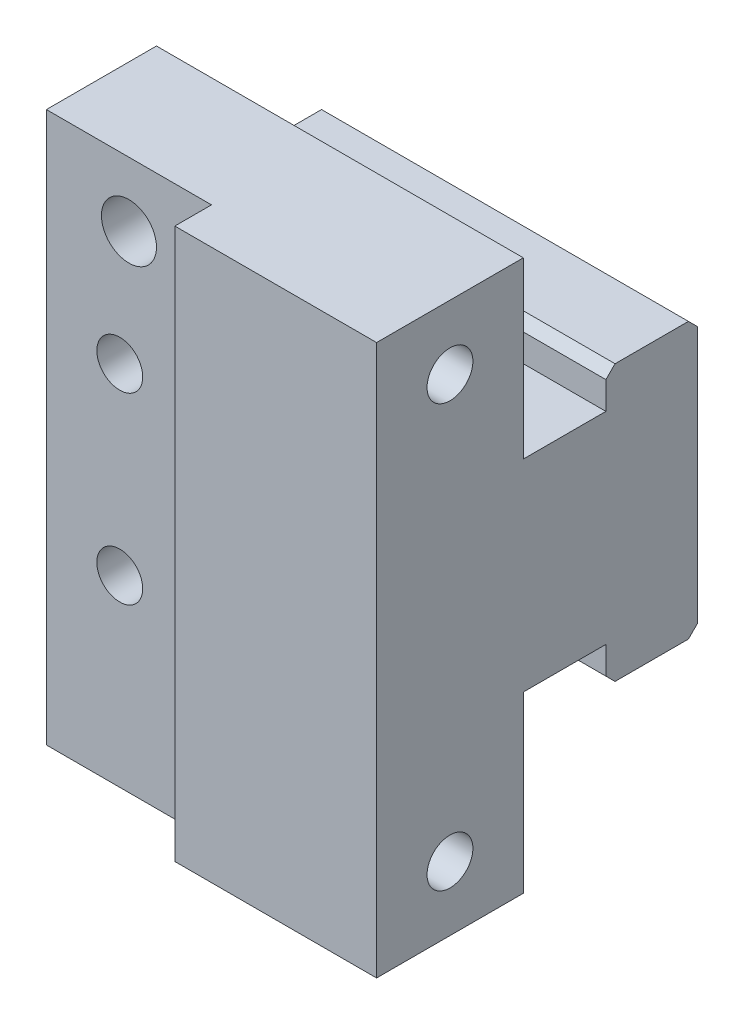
ISO-10303-21;
HEADER;
FILE_DESCRIPTION(('STEP AP214'),'2;1');
FILE_NAME('part.step','',(''),(''),'','','');
FILE_SCHEMA(('AUTOMOTIVE_DESIGN { 1 0 10303 214 1 1 1 1 }'));
ENDSEC;
DATA;
#1=APPLICATION_CONTEXT('core data for automotive mechanical design processes');
#2=APPLICATION_PROTOCOL_DEFINITION('international standard','automotive_design',2000,#1);
#3=PRODUCT_CONTEXT('',#1,'mechanical');
#4=PRODUCT('Part','Part','',(#3));
#5=PRODUCT_RELATED_PRODUCT_CATEGORY('part','',(#4));
#6=PRODUCT_DEFINITION_FORMATION('','',#4);
#7=PRODUCT_DEFINITION_CONTEXT('part definition',#1,'design');
#8=PRODUCT_DEFINITION('design','',#6,#7);
#9=PRODUCT_DEFINITION_SHAPE('','',#8);
#10=(LENGTH_UNIT() NAMED_UNIT(*) SI_UNIT(.MILLI.,.METRE.));
#11=(NAMED_UNIT(*) PLANE_ANGLE_UNIT() SI_UNIT($,.RADIAN.));
#12=(NAMED_UNIT(*) SI_UNIT($,.STERADIAN.) SOLID_ANGLE_UNIT());
#13=UNCERTAINTY_MEASURE_WITH_UNIT(LENGTH_MEASURE(1.E-05),#10,'distance_accuracy_value','');
#14=(GEOMETRIC_REPRESENTATION_CONTEXT(3) GLOBAL_UNCERTAINTY_ASSIGNED_CONTEXT((#13)) GLOBAL_UNIT_ASSIGNED_CONTEXT((#10,
#11,#12)) REPRESENTATION_CONTEXT('',''));
#15=CARTESIAN_POINT('',(0.,0.,0.));
#16=DIRECTION('',(0.,0.,1.));
#17=DIRECTION('',(1.,0.,0.));
#18=AXIS2_PLACEMENT_3D('',#15,#16,#17);
#19=CARTESIAN_POINT('',(0.,-30.,0.));
#20=DIRECTION('',(1.,0.,0.));
#21=DIRECTION('',(0.,0.,-1.));
#22=AXIS2_PLACEMENT_3D('',#19,#20,#21);
#23=PLANE('',#22);
#24=DIRECTION('',(0.,0.,1.));
#25=VECTOR('',#24,1.);
#26=CARTESIAN_POINT('',(0.,-7.5,-12.5));
#27=LINE('',#26,#25);
#28=CARTESIAN_POINT('',(0.,-7.5,-17.));
#29=VERTEX_POINT('',#28);
#30=CARTESIAN_POINT('',(0.,-7.5,-13.));
#31=VERTEX_POINT('',#30);
#32=EDGE_CURVE('E296',#29,#31,#27,.T.);
#33=ORIENTED_EDGE('',*,*,#32,.F.);
#34=DIRECTION('',(0.,0.707106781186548,0.707106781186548));
#35=VECTOR('',#34,1.);
#36=CARTESIAN_POINT('',(0.,-7.5,-17.));
#37=LINE('',#36,#35);
#38=CARTESIAN_POINT('',(0.,-7.99999999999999,-17.5));
#39=VERTEX_POINT('',#38);
#40=EDGE_CURVE('E455',#29,#39,#37,.F.);
#41=ORIENTED_EDGE('',*,*,#40,.T.);
#42=DIRECTION('',(0.,1.,0.));
#43=VECTOR('',#42,1.);
#44=CARTESIAN_POINT('',(0.,-7.5,-17.5));
#45=LINE('',#44,#43);
#46=CARTESIAN_POINT('',(0.,-22.,-17.5));
#47=VERTEX_POINT('',#46);
#48=EDGE_CURVE('E293',#47,#39,#45,.T.);
#49=ORIENTED_EDGE('',*,*,#48,.F.);
#50=DIRECTION('',(0.,0.707106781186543,-0.707106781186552));
#51=VECTOR('',#50,1.);
#52=CARTESIAN_POINT('',(0.,-22.,-17.5));
#53=LINE('',#52,#51);
#54=CARTESIAN_POINT('',(0.,-22.5,-17.));
#55=VERTEX_POINT('',#54);
#56=EDGE_CURVE('E449',#47,#55,#53,.F.);
#57=ORIENTED_EDGE('',*,*,#56,.T.);
#58=DIRECTION('',(0.,0.,-1.));
#59=VECTOR('',#58,1.);
#60=CARTESIAN_POINT('',(0.,-22.5,-12.5));
#61=LINE('',#60,#59);
#62=CARTESIAN_POINT('',(0.,-22.5,-13.));
#63=VERTEX_POINT('',#62);
#64=EDGE_CURVE('E291',#63,#55,#61,.T.);
#65=ORIENTED_EDGE('',*,*,#64,.F.);
#66=DIRECTION('',(0.,-0.70710678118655,-0.707106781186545));
#67=VECTOR('',#66,1.);
#68=CARTESIAN_POINT('',(0.,-22.5,-13.));
#69=LINE('',#68,#67);
#70=CARTESIAN_POINT('',(0.,-22.,-12.5));
#71=VERTEX_POINT('',#70);
#72=EDGE_CURVE('E451',#63,#71,#69,.F.);
#73=ORIENTED_EDGE('',*,*,#72,.T.);
#74=DIRECTION('',(0.,-1.,0.));
#75=VECTOR('',#74,1.);
#76=CARTESIAN_POINT('',(0.,-22.5,-12.5));
#77=LINE('',#76,#75);
#78=CARTESIAN_POINT('',(0.,-20.5,-12.5));
#79=VERTEX_POINT('',#78);
#80=EDGE_CURVE('E288',#79,#71,#77,.T.);
#81=ORIENTED_EDGE('',*,*,#80,.F.);
#82=DIRECTION('',(0.,0.,-1.));
#83=VECTOR('',#82,1.);
#84=CARTESIAN_POINT('',(0.,-20.5,-8.));
#85=LINE('',#84,#83);
#86=CARTESIAN_POINT('',(0.,-20.5,-8.));
#87=VERTEX_POINT('',#86);
#88=EDGE_CURVE('E286',#87,#79,#85,.T.);
#89=ORIENTED_EDGE('',*,*,#88,.F.);
#90=DIRECTION('',(0.,1.,0.));
#91=VECTOR('',#90,1.);
#92=CARTESIAN_POINT('',(0.,-30.,-8.));
#93=LINE('',#92,#91);
#94=CARTESIAN_POINT('',(0.,-30.,-8.));
#95=VERTEX_POINT('',#94);
#96=EDGE_CURVE('E283',#95,#87,#93,.T.);
#97=ORIENTED_EDGE('',*,*,#96,.F.);
#98=DIRECTION('',(0.,0.,-1.));
#99=VECTOR('',#98,1.);
#100=CARTESIAN_POINT('',(0.,-30.,0.));
#101=LINE('',#100,#99);
#102=CARTESIAN_POINT('',(0.,-30.,-2.));
#103=VERTEX_POINT('',#102);
#104=EDGE_CURVE('E251',#103,#95,#101,.T.);
#105=ORIENTED_EDGE('',*,*,#104,.F.);
#106=DIRECTION('',(0.,-1.,0.));
#107=VECTOR('',#106,1.);
#108=CARTESIAN_POINT('',(0.,0.,-2.));
#109=LINE('',#108,#107);
#110=CARTESIAN_POINT('',(0.,0.,-2.));
#111=VERTEX_POINT('',#110);
#112=EDGE_CURVE('E236',#111,#103,#109,.T.);
#113=ORIENTED_EDGE('',*,*,#112,.F.);
#114=DIRECTION('',(0.,0.,1.));
#115=VECTOR('',#114,1.);
#116=CARTESIAN_POINT('',(0.,0.,0.));
#117=LINE('',#116,#115);
#118=CARTESIAN_POINT('',(0.,0.,-8.));
#119=VERTEX_POINT('',#118);
#120=EDGE_CURVE('E257',#119,#111,#117,.T.);
#121=ORIENTED_EDGE('',*,*,#120,.F.);
#122=DIRECTION('',(0.,1.,0.));
#123=VECTOR('',#122,1.);
#124=CARTESIAN_POINT('',(0.,0.,-8.));
#125=LINE('',#124,#123);
#126=CARTESIAN_POINT('',(0.,-9.5,-8.));
#127=VERTEX_POINT('',#126);
#128=EDGE_CURVE('E304',#127,#119,#125,.T.);
#129=ORIENTED_EDGE('',*,*,#128,.F.);
#130=DIRECTION('',(0.,0.,1.));
#131=VECTOR('',#130,1.);
#132=CARTESIAN_POINT('',(0.,-9.5,-8.));
#133=LINE('',#132,#131);
#134=CARTESIAN_POINT('',(0.,-9.5,-12.5));
#135=VERTEX_POINT('',#134);
#136=EDGE_CURVE('E301',#135,#127,#133,.T.);
#137=ORIENTED_EDGE('',*,*,#136,.F.);
#138=DIRECTION('',(0.,-1.,0.));
#139=VECTOR('',#138,1.);
#140=CARTESIAN_POINT('',(0.,-7.5,-12.5));
#141=LINE('',#140,#139);
#142=CARTESIAN_POINT('',(0.,-8.,-12.5));
#143=VERTEX_POINT('',#142);
#144=EDGE_CURVE('E299',#143,#135,#141,.T.);
#145=ORIENTED_EDGE('',*,*,#144,.F.);
#146=DIRECTION('',(0.,-0.707106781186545,0.70710678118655));
#147=VECTOR('',#146,1.);
#148=CARTESIAN_POINT('',(0.,-8.,-12.5));
#149=LINE('',#148,#147);
#150=EDGE_CURVE('E453',#143,#31,#149,.F.);
#151=ORIENTED_EDGE('',*,*,#150,.T.);
#152=EDGE_LOOP('',(#33,#41,#49,#57,#65,#73,#81,#89,#97,#105,#113,#121,#129,#137,#145,#151));
#153=FACE_BOUND('',#152,.T.);
#154=ADVANCED_FACE('F32',(#153),#23,.F.);
#155=CARTESIAN_POINT('',(20.,0.,0.));
#156=DIRECTION('',(0.,0.,-1.));
#157=DIRECTION('',(-1.,0.,0.));
#158=AXIS2_PLACEMENT_3D('',#155,#156,#157);
#159=PLANE('',#158);
#160=DIRECTION('',(-1.,0.,0.));
#161=VECTOR('',#160,1.);
#162=CARTESIAN_POINT('',(20.,0.,0.));
#163=LINE('',#162,#161);
#164=CARTESIAN_POINT('',(20.,0.,0.));
#165=VERTEX_POINT('',#164);
#166=CARTESIAN_POINT('',(9.,0.,0.));
#167=VERTEX_POINT('',#166);
#168=EDGE_CURVE('E281',#165,#167,#163,.T.);
#169=ORIENTED_EDGE('',*,*,#168,.T.);
#170=DIRECTION('',(0.,1.,0.));
#171=VECTOR('',#170,1.);
#172=CARTESIAN_POINT('',(9.,0.,0.));
#173=LINE('',#172,#171);
#174=CARTESIAN_POINT('',(9.,-30.,0.));
#175=VERTEX_POINT('',#174);
#176=EDGE_CURVE('E235',#175,#167,#173,.T.);
#177=ORIENTED_EDGE('',*,*,#176,.F.);
#178=DIRECTION('',(-1.,0.,0.));
#179=VECTOR('',#178,1.);
#180=CARTESIAN_POINT('',(20.,-30.,0.));
#181=LINE('',#180,#179);
#182=CARTESIAN_POINT('',(20.,-30.,0.));
#183=VERTEX_POINT('',#182);
#184=EDGE_CURVE('E330',#183,#175,#181,.T.);
#185=ORIENTED_EDGE('',*,*,#184,.F.);
#186=DIRECTION('',(0.,-1.,0.));
#187=VECTOR('',#186,1.);
#188=CARTESIAN_POINT('',(20.,0.,0.));
#189=LINE('',#188,#187);
#190=EDGE_CURVE('E253',#165,#183,#189,.T.);
#191=ORIENTED_EDGE('',*,*,#190,.F.);
#192=EDGE_LOOP('',(#169,#177,#185,#191));
#193=FACE_BOUND('',#192,.T.);
#194=ADVANCED_FACE('F362',(#193),#159,.F.);
#195=CARTESIAN_POINT('',(20.,-30.,0.));
#196=DIRECTION('',(0.,1.,0.));
#197=DIRECTION('',(0.,0.,1.));
#198=AXIS2_PLACEMENT_3D('',#195,#196,#197);
#199=PLANE('',#198);
#200=ORIENTED_EDGE('',*,*,#184,.T.);
#201=DIRECTION('',(0.,0.,1.));
#202=VECTOR('',#201,1.);
#203=CARTESIAN_POINT('',(9.,-30.,-2.));
#204=LINE('',#203,#202);
#205=CARTESIAN_POINT('',(9.,-30.,-2.));
#206=VERTEX_POINT('',#205);
#207=EDGE_CURVE('E246',#206,#175,#204,.T.);
#208=ORIENTED_EDGE('',*,*,#207,.F.);
#209=DIRECTION('',(1.,0.,0.));
#210=VECTOR('',#209,1.);
#211=CARTESIAN_POINT('',(0.,-30.,-2.));
#212=LINE('',#211,#210);
#213=EDGE_CURVE('E238',#103,#206,#212,.T.);
#214=ORIENTED_EDGE('',*,*,#213,.F.);
#215=ORIENTED_EDGE('',*,*,#104,.T.);
#216=DIRECTION('',(-1.,0.,0.));
#217=VECTOR('',#216,1.);
#218=CARTESIAN_POINT('',(20.,-30.,-8.));
#219=LINE('',#218,#217);
#220=CARTESIAN_POINT('',(20.,-30.,-8.));
#221=VERTEX_POINT('',#220);
#222=EDGE_CURVE('E327',#221,#95,#219,.T.);
#223=ORIENTED_EDGE('',*,*,#222,.F.);
#224=DIRECTION('',(0.,0.,-1.));
#225=VECTOR('',#224,1.);
#226=CARTESIAN_POINT('',(20.,-30.,0.));
#227=LINE('',#226,#225);
#228=EDGE_CURVE('E256',#183,#221,#227,.T.);
#229=ORIENTED_EDGE('',*,*,#228,.F.);
#230=EDGE_LOOP('',(#200,#208,#214,#215,#223,#229));
#231=FACE_BOUND('',#230,.T.);
#232=ADVANCED_FACE('F358',(#231),#199,.F.);
#233=CARTESIAN_POINT('',(20.,-30.,-8.));
#234=DIRECTION('',(0.,0.,1.));
#235=DIRECTION('',(0.,-1.,0.));
#236=AXIS2_PLACEMENT_3D('',#233,#234,#235);
#237=PLANE('',#236);
#238=DIRECTION('',(-1.,0.,0.));
#239=VECTOR('',#238,1.);
#240=CARTESIAN_POINT('',(20.,-20.5,-8.));
#241=LINE('',#240,#239);
#242=CARTESIAN_POINT('',(2.85435607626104,-20.5,-8.));
#243=VERTEX_POINT('',#242);
#244=EDGE_CURVE('E323',#243,#87,#241,.T.);
#245=ORIENTED_EDGE('',*,*,#244,.F.);
#246=CARTESIAN_POINT('',(4.,-20.,-8.));
#247=DIRECTION('',(0.,0.,1.));
#248=DIRECTION('',(0.,-1.,0.));
#249=AXIS2_PLACEMENT_3D('',#246,#247,#248);
#250=CIRCLE('',#249,1.25);
#251=CARTESIAN_POINT('',(5.14564392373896,-20.5,-8.));
#252=VERTEX_POINT('',#251);
#253=EDGE_CURVE('E232',#243,#252,#250,.T.);
#254=ORIENTED_EDGE('',*,*,#253,.T.);
#255=CARTESIAN_POINT('',(20.,-20.5,-8.));
#256=VERTEX_POINT('',#255);
#257=EDGE_CURVE('E324',#256,#252,#241,.T.);
#258=ORIENTED_EDGE('',*,*,#257,.F.);
#259=DIRECTION('',(0.,1.,0.));
#260=VECTOR('',#259,1.);
#261=CARTESIAN_POINT('',(20.,-30.,-8.));
#262=LINE('',#261,#260);
#263=EDGE_CURVE('E259',#221,#256,#262,.T.);
#264=ORIENTED_EDGE('',*,*,#263,.F.);
#265=ORIENTED_EDGE('',*,*,#222,.T.);
#266=ORIENTED_EDGE('',*,*,#96,.T.);
#267=EDGE_LOOP('',(#245,#254,#258,#264,#265,#266));
#268=FACE_BOUND('',#267,.T.);
#269=ADVANCED_FACE('F353',(#268),#237,.F.);
#270=CARTESIAN_POINT('',(20.,-20.5,-8.));
#271=DIRECTION('',(0.,1.,0.));
#272=DIRECTION('',(0.,0.,1.));
#273=AXIS2_PLACEMENT_3D('',#270,#271,#272);
#274=PLANE('',#273);
#275=CARTESIAN_POINT('',(-2.41999922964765,-20.5,-6.38186974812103));
#276=CARTESIAN_POINT('',(-2.19441727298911,-20.5,-6.51700026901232));
#277=CARTESIAN_POINT('',(-1.96881932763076,-20.5,-6.65210413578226));
#278=CARTESIAN_POINT('',(-1.51756293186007,-20.5,-6.92222668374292));
#279=CARTESIAN_POINT('',(-1.29190447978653,-20.5,-7.05724536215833));
#280=CARTESIAN_POINT('',(-0.840333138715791,-20.5,-7.32726453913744));
#281=CARTESIAN_POINT('',(-0.614420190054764,-20.5,-7.4622649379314));
#282=CARTESIAN_POINT('',(-0.162486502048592,-20.5,-7.73206975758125));
#283=CARTESIAN_POINT('',(0.0635342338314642,-20.5,-7.86687418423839));
#284=CARTESIAN_POINT('',(0.512094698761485,-20.5,-8.13398164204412));
#285=CARTESIAN_POINT('',(0.734631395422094,-20.5,-8.26628976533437));
#286=CARTESIAN_POINT('',(1.18003986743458,-20.5,-8.53038665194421));
#287=CARTESIAN_POINT('',(1.40291167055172,-20.5,-8.66217536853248));
#288=CARTESIAN_POINT('',(1.73765614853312,-20.5,-8.85898572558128));
#289=CARTESIAN_POINT('',(1.8492817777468,-20.5,-8.92442706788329));
#290=CARTESIAN_POINT('',(2.072797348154,-20.5,-9.05486545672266));
#291=CARTESIAN_POINT('',(2.18468729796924,-20.5,-9.11986248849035));
#292=CARTESIAN_POINT('',(2.40886995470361,-20.5,-9.24911943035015));
#293=CARTESIAN_POINT('',(2.52116259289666,-20.5,-9.31337945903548));
#294=CARTESIAN_POINT('',(2.69017844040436,-20.5,-9.40874119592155));
#295=CARTESIAN_POINT('',(2.74661169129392,-20.5,-9.44035622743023));
#296=CARTESIAN_POINT('',(2.85975424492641,-20.5,-9.50308782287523));
#297=CARTESIAN_POINT('',(2.91646354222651,-20.5,-9.53420439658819));
#298=CARTESIAN_POINT('',(2.99680500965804,-20.5,-9.57760336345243));
#299=CARTESIAN_POINT('',(3.02026927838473,-20.5,-9.59019641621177));
#300=CARTESIAN_POINT('',(3.06728021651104,-20.5,-9.61522790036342));
#301=CARTESIAN_POINT('',(3.09082688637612,-20.5,-9.62766633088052));
#302=CARTESIAN_POINT('',(3.16162039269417,-20.5,-9.6647091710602));
#303=CARTESIAN_POINT('',(3.20901319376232,-20.5,-9.68903703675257));
#304=CARTESIAN_POINT('',(3.304743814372,-20.5,-9.73676563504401));
#305=CARTESIAN_POINT('',(3.35308617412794,-20.5,-9.76015729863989));
#306=CARTESIAN_POINT('',(3.4506116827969,-20.5,-9.80512578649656));
#307=CARTESIAN_POINT('',(3.49979459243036,-20.5,-9.8267031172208));
#308=CARTESIAN_POINT('',(3.57871586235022,-20.5,-9.85843329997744));
#309=CARTESIAN_POINT('',(3.60803998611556,-20.5,-9.86960714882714));
#310=CARTESIAN_POINT('',(3.66722630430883,-20.5,-9.8904781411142));
#311=CARTESIAN_POINT('',(3.69708863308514,-20.5,-9.90017490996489));
#312=CARTESIAN_POINT('',(3.75701051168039,-20.5,-9.9174153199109));
#313=CARTESIAN_POINT('',(3.78706209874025,-20.5,-9.92498599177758));
#314=CARTESIAN_POINT('',(3.84769885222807,-20.5,-9.93748189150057));
#315=CARTESIAN_POINT('',(3.87828347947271,-20.5,-9.94240964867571));
#316=CARTESIAN_POINT('',(3.94048505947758,-20.5,-9.9490934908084));
#317=CARTESIAN_POINT('',(3.97211002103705,-20.5,-9.95077853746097));
#318=CARTESIAN_POINT('',(4.03533806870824,-20.5,-9.95049572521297));
#319=CARTESIAN_POINT('',(4.06694115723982,-20.5,-9.94852837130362));
#320=CARTESIAN_POINT('',(4.13013712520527,-20.5,-9.94120511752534));
#321=CARTESIAN_POINT('',(4.16172488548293,-20.5,-9.93580694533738));
#322=CARTESIAN_POINT('',(4.22430707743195,-20.5,-9.9222677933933));
#323=CARTESIAN_POINT('',(4.25530108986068,-20.5,-9.91412494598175));
#324=CARTESIAN_POINT('',(4.3305838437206,-20.5,-9.89167341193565));
#325=CARTESIAN_POINT('',(4.37453102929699,-20.5,-9.87624289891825));
#326=CARTESIAN_POINT('',(4.46142581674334,-20.5,-9.84275330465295));
#327=CARTESIAN_POINT('',(4.50437233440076,-20.5,-9.82469151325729));
#328=CARTESIAN_POINT('',(4.58962701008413,-20.5,-9.78688110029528));
#329=CARTESIAN_POINT('',(4.63193346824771,-20.5,-9.76712868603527));
#330=CARTESIAN_POINT('',(4.71602750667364,-20.5,-9.72654336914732));
#331=CARTESIAN_POINT('',(4.75781500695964,-20.5,-9.70571030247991));
#332=CARTESIAN_POINT('',(4.88350348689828,-20.5,-9.64169600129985));
#333=CARTESIAN_POINT('',(4.9668413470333,-20.5,-9.59741452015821));
#334=CARTESIAN_POINT('',(5.13256928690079,-20.5,-9.50749061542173));
#335=CARTESIAN_POINT('',(5.21496082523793,-20.5,-9.46185083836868));
#336=CARTESIAN_POINT('',(5.38026226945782,-20.5,-9.36917534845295));
#337=CARTESIAN_POINT('',(5.46316645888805,-20.5,-9.32212944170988));
#338=CARTESIAN_POINT('',(5.62867047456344,-20.5,-9.22750653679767));
#339=CARTESIAN_POINT('',(5.71127029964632,-20.5,-9.17992953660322));
#340=CARTESIAN_POINT('',(5.9587800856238,-20.5,-9.03668029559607));
#341=CARTESIAN_POINT('',(6.12339245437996,-20.5,-8.94049430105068));
#342=CARTESIAN_POINT('',(6.4523773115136,-20.5,-8.74736638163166));
#343=CARTESIAN_POINT('',(6.61674943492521,-20.5,-8.65042383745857));
#344=CARTESIAN_POINT('',(6.94525908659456,-20.5,-8.45615070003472));
#345=CARTESIAN_POINT('',(7.10939662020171,-20.5,-8.35882011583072));
#346=CARTESIAN_POINT('',(7.42739732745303,-20.5,-8.16993543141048));
#347=CARTESIAN_POINT('',(7.58126907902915,-20.5,-8.07839575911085));
#348=CARTESIAN_POINT('',(7.8889272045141,-20.5,-7.89517041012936));
#349=CARTESIAN_POINT('',(8.0427135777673,-20.5,-7.8034847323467));
#350=CARTESIAN_POINT('',(8.35007033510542,-20.5,-7.62010336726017));
#351=CARTESIAN_POINT('',(8.50364078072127,-20.5,-7.52840778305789));
#352=CARTESIAN_POINT('',(8.81073446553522,-20.5,-7.34494042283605));
#353=CARTESIAN_POINT('',(8.96425770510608,-20.5,-7.25316864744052));
#354=CARTESIAN_POINT('',(9.11776548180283,-20.5,-7.16137103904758));
#355=B_SPLINE_CURVE_WITH_KNOTS('',3,(#275,#276,#277,#278,#279,#280,#281,#282,#283,#284,#285,
#286,#287,#288,#289,#290,#291,#292,#293,#294,#295,#296,#297,#298,#299,#300,#301,#302,#303,#304,
#305,#306,#307,#308,#309,#310,#311,#312,#313,#314,#315,#316,#317,#318,#319,#320,#321,#322,#323,
#324,#325,#326,#327,#328,#329,#330,#331,#332,#333,#334,#335,#336,#337,#338,#339,#340,#341,#342,
#343,#344,#345,#346,#347,#348,#349,#350,#351,#352,#353,#354),.UNSPECIFIED.,.F.,.F.,(4,2,2,2,2,2,
2,2,2,2,2,2,2,2,2,2,2,2,2,2,2,2,2,2,2,2,2,2,2,2,2,2,2,2,2,2,2,2,2,4),(0.,0.788877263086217,
1.57777902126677,2.36730789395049,3.15681289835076,3.93350580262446,4.71026706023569,
5.09844880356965,5.48664338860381,5.87477460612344,6.06882986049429,6.26288130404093,
6.34277076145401,6.42266067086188,6.58246620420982,6.74356169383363,6.90461206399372,
6.99872724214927,7.09286624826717,7.18574776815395,7.27854023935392,7.37334336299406,
7.46813337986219,7.56411459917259,7.66016126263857,7.79974185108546,7.93946723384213,
8.07951472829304,8.21958354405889,8.50266255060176,8.78522208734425,9.07118633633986,
9.35715167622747,9.92910961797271,10.50159896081,11.0740750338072,11.6112008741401,
12.1483307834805,12.6849196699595,13.2215042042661),.UNSPECIFIED.);
#356=CARTESIAN_POINT('',(5.14564392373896,-20.5,-9.5));
#357=VERTEX_POINT('',#356);
#358=CARTESIAN_POINT('',(2.85435607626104,-20.5,-9.5));
#359=VERTEX_POINT('',#358);
#360=EDGE_CURVE('E333',#357,#359,#355,.F.);
#361=ORIENTED_EDGE('',*,*,#360,.T.);
#362=DIRECTION('',(0.,0.,1.));
#363=VECTOR('',#362,1.);
#364=CARTESIAN_POINT('',(2.85435607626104,-20.5,-2.));
#365=LINE('',#364,#363);
#366=EDGE_CURVE('E416',#359,#243,#365,.T.);
#367=ORIENTED_EDGE('',*,*,#366,.T.);
#368=ORIENTED_EDGE('',*,*,#244,.T.);
#369=ORIENTED_EDGE('',*,*,#88,.T.);
#370=DIRECTION('',(-1.,0.,0.));
#371=VECTOR('',#370,1.);
#372=CARTESIAN_POINT('',(20.,-20.5,-12.5));
#373=LINE('',#372,#371);
#374=CARTESIAN_POINT('',(20.,-20.5,-12.5));
#375=VERTEX_POINT('',#374);
#376=EDGE_CURVE('E320',#375,#79,#373,.T.);
#377=ORIENTED_EDGE('',*,*,#376,.F.);
#378=DIRECTION('',(0.,0.,-1.));
#379=VECTOR('',#378,1.);
#380=CARTESIAN_POINT('',(20.,-20.5,-8.));
#381=LINE('',#380,#379);
#382=EDGE_CURVE('E261',#256,#375,#381,.T.);
#383=ORIENTED_EDGE('',*,*,#382,.F.);
#384=ORIENTED_EDGE('',*,*,#257,.T.);
#385=DIRECTION('',(0.,0.,1.));
#386=VECTOR('',#385,1.);
#387=CARTESIAN_POINT('',(5.14564392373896,-20.5,-2.));
#388=LINE('',#387,#386);
#389=EDGE_CURVE('E341',#252,#357,#388,.F.);
#390=ORIENTED_EDGE('',*,*,#389,.T.);
#391=EDGE_LOOP('',(#361,#367,#368,#369,#377,#383,#384,#390));
#392=FACE_BOUND('',#391,.T.);
#393=ADVANCED_FACE('F347',(#392),#274,.F.);
#394=CARTESIAN_POINT('',(20.,-22.5,-12.5));
#395=DIRECTION('',(0.,0.,-1.));
#396=DIRECTION('',(-1.,0.,0.));
#397=AXIS2_PLACEMENT_3D('',#394,#395,#396);
#398=PLANE('',#397);
#399=ORIENTED_EDGE('',*,*,#80,.T.);
#400=DIRECTION('',(1.,0.,0.));
#401=VECTOR('',#400,1.);
#402=CARTESIAN_POINT('',(20.,-22.,-12.5));
#403=LINE('',#402,#401);
#404=CARTESIAN_POINT('',(20.,-22.,-12.5));
#405=VERTEX_POINT('',#404);
#406=EDGE_CURVE('E11',#71,#405,#403,.T.);
#407=ORIENTED_EDGE('',*,*,#406,.T.);
#408=DIRECTION('',(0.,-1.,0.));
#409=VECTOR('',#408,1.);
#410=CARTESIAN_POINT('',(20.,-22.5,-12.5));
#411=LINE('',#410,#409);
#412=EDGE_CURVE('E263',#375,#405,#411,.T.);
#413=ORIENTED_EDGE('',*,*,#412,.F.);
#414=ORIENTED_EDGE('',*,*,#376,.T.);
#415=EDGE_LOOP('',(#399,#407,#413,#414));
#416=FACE_BOUND('',#415,.T.);
#417=ADVANCED_FACE('F352',(#416),#398,.F.);
#418=CARTESIAN_POINT('',(20.,-22.5,-12.5));
#419=DIRECTION('',(0.,1.,0.));
#420=DIRECTION('',(0.,0.,1.));
#421=AXIS2_PLACEMENT_3D('',#418,#419,#420);
#422=PLANE('',#421);
#423=DIRECTION('',(0.,0.,-1.));
#424=VECTOR('',#423,1.);
#425=CARTESIAN_POINT('',(20.,-22.5,-12.5));
#426=LINE('',#425,#424);
#427=CARTESIAN_POINT('',(20.,-22.5,-13.));
#428=VERTEX_POINT('',#427);
#429=CARTESIAN_POINT('',(20.,-22.5,-17.));
#430=VERTEX_POINT('',#429);
#431=EDGE_CURVE('E266',#428,#430,#426,.T.);
#432=ORIENTED_EDGE('',*,*,#431,.F.);
#433=DIRECTION('',(-1.,0.,0.));
#434=VECTOR('',#433,1.);
#435=CARTESIAN_POINT('',(20.,-22.5,-13.));
#436=LINE('',#435,#434);
#437=EDGE_CURVE('E40',#428,#63,#436,.T.);
#438=ORIENTED_EDGE('',*,*,#437,.T.);
#439=ORIENTED_EDGE('',*,*,#64,.T.);
#440=DIRECTION('',(1.,0.,0.));
#441=VECTOR('',#440,1.);
#442=CARTESIAN_POINT('',(20.,-22.5,-17.));
#443=LINE('',#442,#441);
#444=EDGE_CURVE('E55',#55,#430,#443,.T.);
#445=ORIENTED_EDGE('',*,*,#444,.T.);
#446=EDGE_LOOP('',(#432,#438,#439,#445));
#447=FACE_BOUND('',#446,.T.);
#448=ADVANCED_FACE('F475',(#447),#422,.F.);
#449=CARTESIAN_POINT('',(20.,-7.5,-17.5));
#450=DIRECTION('',(0.,0.,1.));
#451=DIRECTION('',(1.,0.,0.));
#452=AXIS2_PLACEMENT_3D('',#449,#450,#451);
#453=PLANE('',#452);
#454=ORIENTED_EDGE('',*,*,#48,.T.);
#455=DIRECTION('',(1.,0.,0.));
#456=VECTOR('',#455,1.);
#457=CARTESIAN_POINT('',(20.,-7.99999999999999,-17.5));
#458=LINE('',#457,#456);
#459=CARTESIAN_POINT('',(20.,-8.,-17.5));
#460=VERTEX_POINT('',#459);
#461=EDGE_CURVE('E460',#39,#460,#458,.T.);
#462=ORIENTED_EDGE('',*,*,#461,.T.);
#463=DIRECTION('',(0.,1.,0.));
#464=VECTOR('',#463,1.);
#465=CARTESIAN_POINT('',(20.,-7.5,-17.5));
#466=LINE('',#465,#464);
#467=CARTESIAN_POINT('',(20.,-22.,-17.5));
#468=VERTEX_POINT('',#467);
#469=EDGE_CURVE('E268',#468,#460,#466,.T.);
#470=ORIENTED_EDGE('',*,*,#469,.F.);
#471=DIRECTION('',(-1.,0.,0.));
#472=VECTOR('',#471,1.);
#473=CARTESIAN_POINT('',(20.,-22.,-17.5));
#474=LINE('',#473,#472);
#475=EDGE_CURVE('E457',#468,#47,#474,.T.);
#476=ORIENTED_EDGE('',*,*,#475,.T.);
#477=EDGE_LOOP('',(#454,#462,#470,#476));
#478=FACE_BOUND('',#477,.T.);
#479=ADVANCED_FACE('F482',(#478),#453,.F.);
#480=CARTESIAN_POINT('',(20.,-7.5,-12.5));
#481=DIRECTION('',(0.,-1.,0.));
#482=DIRECTION('',(0.,0.,-1.));
#483=AXIS2_PLACEMENT_3D('',#480,#481,#482);
#484=PLANE('',#483);
#485=DIRECTION('',(0.,0.,1.));
#486=VECTOR('',#485,1.);
#487=CARTESIAN_POINT('',(20.,-7.5,-12.5));
#488=LINE('',#487,#486);
#489=CARTESIAN_POINT('',(20.,-7.5,-17.));
#490=VERTEX_POINT('',#489);
#491=CARTESIAN_POINT('',(20.,-7.5,-13.));
#492=VERTEX_POINT('',#491);
#493=EDGE_CURVE('E271',#490,#492,#488,.T.);
#494=ORIENTED_EDGE('',*,*,#493,.F.);
#495=DIRECTION('',(-1.,0.,0.));
#496=VECTOR('',#495,1.);
#497=CARTESIAN_POINT('',(20.,-7.5,-17.));
#498=LINE('',#497,#496);
#499=EDGE_CURVE('E444',#490,#29,#498,.T.);
#500=ORIENTED_EDGE('',*,*,#499,.T.);
#501=ORIENTED_EDGE('',*,*,#32,.T.);
#502=DIRECTION('',(1.,0.,0.));
#503=VECTOR('',#502,1.);
#504=CARTESIAN_POINT('',(20.,-7.5,-13.));
#505=LINE('',#504,#503);
#506=EDGE_CURVE('E442',#31,#492,#505,.T.);
#507=ORIENTED_EDGE('',*,*,#506,.T.);
#508=EDGE_LOOP('',(#494,#500,#501,#507));
#509=FACE_BOUND('',#508,.T.);
#510=ADVANCED_FACE('F488',(#509),#484,.F.);
#511=CARTESIAN_POINT('',(20.,-7.5,-12.5));
#512=DIRECTION('',(0.,0.,-1.));
#513=DIRECTION('',(-1.,0.,0.));
#514=AXIS2_PLACEMENT_3D('',#511,#512,#513);
#515=PLANE('',#514);
#516=DIRECTION('',(0.,-1.,0.));
#517=VECTOR('',#516,1.);
#518=CARTESIAN_POINT('',(20.,-7.5,-12.5));
#519=LINE('',#518,#517);
#520=CARTESIAN_POINT('',(20.,-7.99999999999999,-12.5));
#521=VERTEX_POINT('',#520);
#522=CARTESIAN_POINT('',(20.,-9.5,-12.5));
#523=VERTEX_POINT('',#522);
#524=EDGE_CURVE('E273',#521,#523,#519,.T.);
#525=ORIENTED_EDGE('',*,*,#524,.F.);
#526=DIRECTION('',(-1.,0.,0.));
#527=VECTOR('',#526,1.);
#528=CARTESIAN_POINT('',(20.,-8.,-12.5));
#529=LINE('',#528,#527);
#530=EDGE_CURVE('E469',#521,#143,#529,.T.);
#531=ORIENTED_EDGE('',*,*,#530,.T.);
#532=ORIENTED_EDGE('',*,*,#144,.T.);
#533=DIRECTION('',(-1.,0.,0.));
#534=VECTOR('',#533,1.);
#535=CARTESIAN_POINT('',(20.,-9.5,-12.5));
#536=LINE('',#535,#534);
#537=EDGE_CURVE('E317',#523,#135,#536,.T.);
#538=ORIENTED_EDGE('',*,*,#537,.F.);
#539=EDGE_LOOP('',(#525,#531,#532,#538));
#540=FACE_BOUND('',#539,.T.);
#541=ADVANCED_FACE('F404',(#540),#515,.F.);
#542=CARTESIAN_POINT('',(20.,-9.5,-8.));
#543=DIRECTION('',(0.,-1.,0.));
#544=DIRECTION('',(0.,0.,-1.));
#545=AXIS2_PLACEMENT_3D('',#542,#543,#544);
#546=PLANE('',#545);
#547=CARTESIAN_POINT('',(-2.41999922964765,-9.5,-6.38186974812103));
#548=CARTESIAN_POINT('',(-2.19441727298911,-9.5,-6.51700026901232));
#549=CARTESIAN_POINT('',(-1.96881932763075,-9.5,-6.65210413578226));
#550=CARTESIAN_POINT('',(-1.51756293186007,-9.5,-6.92222668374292));
#551=CARTESIAN_POINT('',(-1.29190447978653,-9.5,-7.05724536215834));
#552=CARTESIAN_POINT('',(-0.840333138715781,-9.5,-7.32726453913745));
#553=CARTESIAN_POINT('',(-0.614420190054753,-9.5,-7.4622649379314));
#554=CARTESIAN_POINT('',(-0.162486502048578,-9.5,-7.73206975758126));
#555=CARTESIAN_POINT('',(0.0635342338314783,-9.5,-7.8668741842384));
#556=CARTESIAN_POINT('',(0.512094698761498,-9.5,-8.13398164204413));
#557=CARTESIAN_POINT('',(0.734631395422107,-9.5,-8.26628976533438));
#558=CARTESIAN_POINT('',(1.18003986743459,-9.5,-8.53038665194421));
#559=CARTESIAN_POINT('',(1.40291167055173,-9.5,-8.66217536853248));
#560=CARTESIAN_POINT('',(1.73765614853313,-9.5,-8.85898572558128));
#561=CARTESIAN_POINT('',(1.84928177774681,-9.5,-8.92442706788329));
#562=CARTESIAN_POINT('',(2.072797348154,-9.5,-9.05486545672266));
#563=CARTESIAN_POINT('',(2.18468729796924,-9.5,-9.11986248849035));
#564=CARTESIAN_POINT('',(2.40886995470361,-9.5,-9.24911943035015));
#565=CARTESIAN_POINT('',(2.52116259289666,-9.5,-9.31337945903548));
#566=CARTESIAN_POINT('',(2.69017844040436,-9.5,-9.40874119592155));
#567=CARTESIAN_POINT('',(2.74661169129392,-9.5,-9.44035622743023));
#568=CARTESIAN_POINT('',(2.85975424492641,-9.5,-9.50308782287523));
#569=CARTESIAN_POINT('',(2.91646354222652,-9.5,-9.53420439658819));
#570=CARTESIAN_POINT('',(2.99680500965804,-9.5,-9.57760336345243));
#571=CARTESIAN_POINT('',(3.02026927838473,-9.5,-9.59019641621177));
#572=CARTESIAN_POINT('',(3.06728021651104,-9.5,-9.61522790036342));
#573=CARTESIAN_POINT('',(3.09082688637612,-9.5,-9.62766633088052));
#574=CARTESIAN_POINT('',(3.16162039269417,-9.5,-9.6647091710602));
#575=CARTESIAN_POINT('',(3.20901319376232,-9.5,-9.68903703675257));
#576=CARTESIAN_POINT('',(3.304743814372,-9.5,-9.73676563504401));
#577=CARTESIAN_POINT('',(3.35308617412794,-9.5,-9.76015729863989));
#578=CARTESIAN_POINT('',(3.4506116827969,-9.5,-9.80512578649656));
#579=CARTESIAN_POINT('',(3.49979459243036,-9.5,-9.82670311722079));
#580=CARTESIAN_POINT('',(3.57871586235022,-9.5,-9.85843329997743));
#581=CARTESIAN_POINT('',(3.60803998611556,-9.5,-9.86960714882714));
#582=CARTESIAN_POINT('',(3.66722630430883,-9.5,-9.8904781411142));
#583=CARTESIAN_POINT('',(3.69708863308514,-9.5,-9.90017490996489));
#584=CARTESIAN_POINT('',(3.75701051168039,-9.5,-9.9174153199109));
#585=CARTESIAN_POINT('',(3.78706209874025,-9.5,-9.92498599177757));
#586=CARTESIAN_POINT('',(3.84769885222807,-9.5,-9.93748189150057));
#587=CARTESIAN_POINT('',(3.87828347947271,-9.5,-9.94240964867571));
#588=CARTESIAN_POINT('',(3.94048505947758,-9.5,-9.9490934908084));
#589=CARTESIAN_POINT('',(3.97211002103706,-9.5,-9.95077853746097));
#590=CARTESIAN_POINT('',(4.03533806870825,-9.5,-9.95049572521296));
#591=CARTESIAN_POINT('',(4.06694115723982,-9.5,-9.94852837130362));
#592=CARTESIAN_POINT('',(4.13013712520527,-9.5,-9.94120511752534));
#593=CARTESIAN_POINT('',(4.16172488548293,-9.5,-9.93580694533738));
#594=CARTESIAN_POINT('',(4.22430707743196,-9.5,-9.9222677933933));
#595=CARTESIAN_POINT('',(4.25530108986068,-9.5,-9.91412494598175));
#596=CARTESIAN_POINT('',(4.3305838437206,-9.5,-9.89167341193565));
#597=CARTESIAN_POINT('',(4.374531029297,-9.5,-9.87624289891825));
#598=CARTESIAN_POINT('',(4.46142581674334,-9.5,-9.84275330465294));
#599=CARTESIAN_POINT('',(4.50437233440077,-9.5,-9.82469151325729));
#600=CARTESIAN_POINT('',(4.58962701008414,-9.5,-9.78688110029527));
#601=CARTESIAN_POINT('',(4.63193346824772,-9.5,-9.76712868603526));
#602=CARTESIAN_POINT('',(4.71602750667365,-9.5,-9.72654336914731));
#603=CARTESIAN_POINT('',(4.75781500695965,-9.5,-9.70571030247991));
#604=CARTESIAN_POINT('',(4.8835034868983,-9.5,-9.64169600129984));
#605=CARTESIAN_POINT('',(4.96684134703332,-9.5,-9.5974145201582));
#606=CARTESIAN_POINT('',(5.13256928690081,-9.5,-9.50749061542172));
#607=CARTESIAN_POINT('',(5.21496082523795,-9.5,-9.46185083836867));
#608=CARTESIAN_POINT('',(5.38026226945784,-9.5,-9.36917534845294));
#609=CARTESIAN_POINT('',(5.46316645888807,-9.5,-9.32212944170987));
#610=CARTESIAN_POINT('',(5.62867047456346,-9.5,-9.22750653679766));
#611=CARTESIAN_POINT('',(5.71127029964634,-9.5,-9.1799295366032));
#612=CARTESIAN_POINT('',(5.95878008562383,-9.5,-9.03668029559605));
#613=CARTESIAN_POINT('',(6.12339245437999,-9.5,-8.94049430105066));
#614=CARTESIAN_POINT('',(6.45237731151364,-9.5,-8.74736638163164));
#615=CARTESIAN_POINT('',(6.61674943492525,-9.5,-8.65042383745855));
#616=CARTESIAN_POINT('',(6.9452590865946,-9.5,-8.4561507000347));
#617=CARTESIAN_POINT('',(7.10939662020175,-9.5,-8.35882011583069));
#618=CARTESIAN_POINT('',(7.42739732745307,-9.5,-8.16993543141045));
#619=CARTESIAN_POINT('',(7.5812690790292,-9.5,-8.07839575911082));
#620=CARTESIAN_POINT('',(7.88892720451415,-9.5,-7.89517041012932));
#621=CARTESIAN_POINT('',(8.04271357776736,-9.5,-7.80348473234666));
#622=CARTESIAN_POINT('',(8.35007033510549,-9.5,-7.62010336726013));
#623=CARTESIAN_POINT('',(8.50364078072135,-9.5,-7.52840778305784));
#624=CARTESIAN_POINT('',(8.8107344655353,-9.5,-7.344940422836));
#625=CARTESIAN_POINT('',(8.96425770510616,-9.5,-7.25316864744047));
#626=CARTESIAN_POINT('',(9.11776548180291,-9.5,-7.16137103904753));
#627=B_SPLINE_CURVE_WITH_KNOTS('',3,(#547,#548,#549,#550,#551,#552,#553,#554,#555,#556,#557,
#558,#559,#560,#561,#562,#563,#564,#565,#566,#567,#568,#569,#570,#571,#572,#573,#574,#575,#576,
#577,#578,#579,#580,#581,#582,#583,#584,#585,#586,#587,#588,#589,#590,#591,#592,#593,#594,#595,
#596,#597,#598,#599,#600,#601,#602,#603,#604,#605,#606,#607,#608,#609,#610,#611,#612,#613,#614,
#615,#616,#617,#618,#619,#620,#621,#622,#623,#624,#625,#626),.UNSPECIFIED.,.F.,.F.,(4,2,2,2,2,2,
2,2,2,2,2,2,2,2,2,2,2,2,2,2,2,2,2,2,2,2,2,2,2,2,2,2,2,2,2,2,2,2,2,4),(0.,0.788877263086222,
1.57777902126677,2.36730789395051,3.15681289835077,3.93350580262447,4.7102670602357,
5.09844880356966,5.48664338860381,5.87477460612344,6.06882986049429,6.26288130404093,
6.34277076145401,6.42266067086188,6.58246620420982,6.74356169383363,6.90461206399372,
6.99872724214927,7.09286624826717,7.18574776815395,7.27854023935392,7.37334336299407,
7.46813337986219,7.5641145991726,7.66016126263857,7.79974185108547,7.93946723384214,
8.07951472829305,8.21958354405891,8.50266255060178,8.78522208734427,9.07118633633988,
9.3571516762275,9.92910961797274,10.5015989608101,11.0740750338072,11.6112008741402,
12.1483307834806,12.6849196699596,13.2215042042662),.UNSPECIFIED.);
#628=CARTESIAN_POINT('',(2.85435607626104,-9.5,-9.5));
#629=VERTEX_POINT('',#628);
#630=CARTESIAN_POINT('',(5.14564392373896,-9.5,-9.5));
#631=VERTEX_POINT('',#630);
#632=EDGE_CURVE('E408',#629,#631,#627,.T.);
#633=ORIENTED_EDGE('',*,*,#632,.T.);
#634=DIRECTION('',(0.,0.,1.));
#635=VECTOR('',#634,1.);
#636=CARTESIAN_POINT('',(5.14564392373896,-9.5,-2.));
#637=LINE('',#636,#635);
#638=CARTESIAN_POINT('',(5.14564392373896,-9.5,-8.));
#639=VERTEX_POINT('',#638);
#640=EDGE_CURVE('E439',#631,#639,#637,.T.);
#641=ORIENTED_EDGE('',*,*,#640,.T.);
#642=DIRECTION('',(-1.,0.,0.));
#643=VECTOR('',#642,1.);
#644=CARTESIAN_POINT('',(20.,-9.5,-8.));
#645=LINE('',#644,#643);
#646=CARTESIAN_POINT('',(20.,-9.5,-8.));
#647=VERTEX_POINT('',#646);
#648=EDGE_CURVE('E314',#647,#639,#645,.T.);
#649=ORIENTED_EDGE('',*,*,#648,.F.);
#650=DIRECTION('',(0.,0.,1.));
#651=VECTOR('',#650,1.);
#652=CARTESIAN_POINT('',(20.,-9.5,-8.));
#653=LINE('',#652,#651);
#654=EDGE_CURVE('E275',#523,#647,#653,.T.);
#655=ORIENTED_EDGE('',*,*,#654,.F.);
#656=ORIENTED_EDGE('',*,*,#537,.T.);
#657=ORIENTED_EDGE('',*,*,#136,.T.);
#658=CARTESIAN_POINT('',(2.85435607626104,-9.5,-8.));
#659=VERTEX_POINT('',#658);
#660=EDGE_CURVE('E313',#659,#127,#645,.T.);
#661=ORIENTED_EDGE('',*,*,#660,.F.);
#662=DIRECTION('',(0.,0.,1.));
#663=VECTOR('',#662,1.);
#664=CARTESIAN_POINT('',(2.85435607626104,-9.5,-2.));
#665=LINE('',#664,#663);
#666=EDGE_CURVE('E415',#659,#629,#665,.F.);
#667=ORIENTED_EDGE('',*,*,#666,.T.);
#668=EDGE_LOOP('',(#633,#641,#649,#655,#656,#657,#661,#667));
#669=FACE_BOUND('',#668,.T.);
#670=ADVANCED_FACE('F399',(#669),#546,.F.);
#671=CARTESIAN_POINT('',(20.,0.,-8.));
#672=DIRECTION('',(0.,0.,1.));
#673=DIRECTION('',(0.,-1.,0.));
#674=AXIS2_PLACEMENT_3D('',#671,#672,#673);
#675=PLANE('',#674);
#676=CARTESIAN_POINT('',(4.5,-3.5,-8.));
#677=DIRECTION('',(0.,0.,1.));
#678=DIRECTION('',(0.,-1.,0.));
#679=AXIS2_PLACEMENT_3D('',#676,#677,#678);
#680=CIRCLE('',#679,1.49999999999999);
#681=CARTESIAN_POINT('',(4.5,-4.99999999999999,-8.));
#682=VERTEX_POINT('',#681);
#683=EDGE_CURVE('E204',#682,#682,#680,.T.);
#684=ORIENTED_EDGE('',*,*,#683,.T.);
#685=EDGE_LOOP('',(#684));
#686=FACE_BOUND('',#685,.T.);
#687=ORIENTED_EDGE('',*,*,#648,.T.);
#688=CARTESIAN_POINT('',(4.,-10.,-8.));
#689=DIRECTION('',(0.,0.,1.));
#690=DIRECTION('',(0.,-1.,0.));
#691=AXIS2_PLACEMENT_3D('',#688,#689,#690);
#692=CIRCLE('',#691,1.25);
#693=EDGE_CURVE('E224',#639,#659,#692,.T.);
#694=ORIENTED_EDGE('',*,*,#693,.T.);
#695=ORIENTED_EDGE('',*,*,#660,.T.);
#696=ORIENTED_EDGE('',*,*,#128,.T.);
#697=DIRECTION('',(-1.,0.,0.));
#698=VECTOR('',#697,1.);
#699=CARTESIAN_POINT('',(20.,0.,-8.));
#700=LINE('',#699,#698);
#701=CARTESIAN_POINT('',(20.,0.,-8.));
#702=VERTEX_POINT('',#701);
#703=EDGE_CURVE('E310',#702,#119,#700,.T.);
#704=ORIENTED_EDGE('',*,*,#703,.F.);
#705=DIRECTION('',(0.,1.,0.));
#706=VECTOR('',#705,1.);
#707=CARTESIAN_POINT('',(20.,0.,-8.));
#708=LINE('',#707,#706);
#709=EDGE_CURVE('E277',#647,#702,#708,.T.);
#710=ORIENTED_EDGE('',*,*,#709,.F.);
#711=EDGE_LOOP('',(#687,#694,#695,#696,#704,#710));
#712=FACE_BOUND('',#711,.T.);
#713=ADVANCED_FACE('F395',(#686,#712),#675,.F.);
#714=CARTESIAN_POINT('',(20.,0.,0.));
#715=DIRECTION('',(0.,-1.,0.));
#716=DIRECTION('',(0.,0.,-1.));
#717=AXIS2_PLACEMENT_3D('',#714,#715,#716);
#718=PLANE('',#717);
#719=DIRECTION('',(-1.,0.,0.));
#720=VECTOR('',#719,1.);
#721=CARTESIAN_POINT('',(0.,0.,-2.));
#722=LINE('',#721,#720);
#723=CARTESIAN_POINT('',(9.,0.,-2.));
#724=VERTEX_POINT('',#723);
#725=EDGE_CURVE('E244',#724,#111,#722,.T.);
#726=ORIENTED_EDGE('',*,*,#725,.F.);
#727=DIRECTION('',(0.,0.,1.));
#728=VECTOR('',#727,1.);
#729=CARTESIAN_POINT('',(9.,0.,-2.));
#730=LINE('',#729,#728);
#731=EDGE_CURVE('E248',#724,#167,#730,.T.);
#732=ORIENTED_EDGE('',*,*,#731,.T.);
#733=ORIENTED_EDGE('',*,*,#168,.F.);
#734=DIRECTION('',(0.,0.,1.));
#735=VECTOR('',#734,1.);
#736=CARTESIAN_POINT('',(20.,0.,0.));
#737=LINE('',#736,#735);
#738=EDGE_CURVE('E279',#702,#165,#737,.T.);
#739=ORIENTED_EDGE('',*,*,#738,.F.);
#740=ORIENTED_EDGE('',*,*,#703,.T.);
#741=ORIENTED_EDGE('',*,*,#120,.T.);
#742=EDGE_LOOP('',(#726,#732,#733,#739,#740,#741));
#743=FACE_BOUND('',#742,.T.);
#744=ADVANCED_FACE('F392',(#743),#718,.F.);
#745=CARTESIAN_POINT('',(20.,-30.,0.));
#746=DIRECTION('',(1.,0.,0.));
#747=DIRECTION('',(0.,0.,-1.));
#748=AXIS2_PLACEMENT_3D('',#745,#746,#747);
#749=PLANE('',#748);
#750=CARTESIAN_POINT('',(20.,-3.5,-4.));
#751=DIRECTION('',(1.,0.,0.));
#752=DIRECTION('',(0.,0.,-1.));
#753=AXIS2_PLACEMENT_3D('',#750,#751,#752);
#754=CIRCLE('',#753,1.25);
#755=CARTESIAN_POINT('',(20.,-3.5,-5.25));
#756=VERTEX_POINT('',#755);
#757=EDGE_CURVE('E203',#756,#756,#754,.T.);
#758=ORIENTED_EDGE('',*,*,#757,.F.);
#759=EDGE_LOOP('',(#758));
#760=FACE_BOUND('',#759,.T.);
#761=CARTESIAN_POINT('',(20.,-26.5,-4.));
#762=DIRECTION('',(1.,0.,0.));
#763=DIRECTION('',(0.,0.,-1.));
#764=AXIS2_PLACEMENT_3D('',#761,#762,#763);
#765=CIRCLE('',#764,1.25);
#766=CARTESIAN_POINT('',(20.,-26.5,-5.25));
#767=VERTEX_POINT('',#766);
#768=EDGE_CURVE('E216',#767,#767,#765,.T.);
#769=ORIENTED_EDGE('',*,*,#768,.F.);
#770=EDGE_LOOP('',(#769));
#771=FACE_BOUND('',#770,.T.);
#772=ORIENTED_EDGE('',*,*,#469,.T.);
#773=DIRECTION('',(0.,-0.707106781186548,-0.707106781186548));
#774=VECTOR('',#773,1.);
#775=CARTESIAN_POINT('',(20.,-10.25,-19.75));
#776=LINE('',#775,#774);
#777=EDGE_CURVE('E467',#460,#490,#776,.F.);
#778=ORIENTED_EDGE('',*,*,#777,.T.);
#779=ORIENTED_EDGE('',*,*,#493,.T.);
#780=DIRECTION('',(0.,0.707106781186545,-0.70710678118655));
#781=VECTOR('',#780,1.);
#782=CARTESIAN_POINT('',(20.,-25.2499999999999,4.75000000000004));
#783=LINE('',#782,#781);
#784=EDGE_CURVE('E47',#492,#521,#783,.F.);
#785=ORIENTED_EDGE('',*,*,#784,.T.);
#786=ORIENTED_EDGE('',*,*,#524,.T.);
#787=ORIENTED_EDGE('',*,*,#654,.T.);
#788=ORIENTED_EDGE('',*,*,#709,.T.);
#789=ORIENTED_EDGE('',*,*,#738,.T.);
#790=ORIENTED_EDGE('',*,*,#190,.T.);
#791=ORIENTED_EDGE('',*,*,#228,.T.);
#792=ORIENTED_EDGE('',*,*,#263,.T.);
#793=ORIENTED_EDGE('',*,*,#382,.T.);
#794=ORIENTED_EDGE('',*,*,#412,.T.);
#795=DIRECTION('',(0.,0.70710678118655,0.707106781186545));
#796=VECTOR('',#795,1.);
#797=CARTESIAN_POINT('',(20.,-19.75,-10.25));
#798=LINE('',#797,#796);
#799=EDGE_CURVE('E464',#405,#428,#798,.F.);
#800=ORIENTED_EDGE('',*,*,#799,.T.);
#801=ORIENTED_EDGE('',*,*,#431,.T.);
#802=DIRECTION('',(0.,-0.707106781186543,0.707106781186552));
#803=VECTOR('',#802,1.);
#804=CARTESIAN_POINT('',(20.,-34.75,-4.74999999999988));
#805=LINE('',#804,#803);
#806=EDGE_CURVE('E462',#430,#468,#805,.F.);
#807=ORIENTED_EDGE('',*,*,#806,.T.);
#808=EDGE_LOOP('',(#772,#778,#779,#785,#786,#787,#788,#789,#790,#791,#792,#793,#794,#800,#801,#807));
#809=FACE_BOUND('',#808,.T.);
#810=ADVANCED_FACE('F390',(#760,#771,#809),#749,.T.);
#811=CARTESIAN_POINT('',(9.,0.,-2.));
#812=DIRECTION('',(1.,0.,0.));
#813=DIRECTION('',(0.,1.,0.));
#814=AXIS2_PLACEMENT_3D('',#811,#812,#813);
#815=PLANE('',#814);
#816=ORIENTED_EDGE('',*,*,#176,.T.);
#817=ORIENTED_EDGE('',*,*,#731,.F.);
#818=DIRECTION('',(0.,1.,0.));
#819=VECTOR('',#818,1.);
#820=CARTESIAN_POINT('',(9.,0.,-2.));
#821=LINE('',#820,#819);
#822=EDGE_CURVE('E241',#206,#724,#821,.T.);
#823=ORIENTED_EDGE('',*,*,#822,.F.);
#824=ORIENTED_EDGE('',*,*,#207,.T.);
#825=EDGE_LOOP('',(#816,#817,#823,#824));
#826=FACE_BOUND('',#825,.T.);
#827=ADVANCED_FACE('F534',(#826),#815,.F.);
#828=CARTESIAN_POINT('',(0.,-30.,-2.));
#829=DIRECTION('',(0.,0.,1.));
#830=DIRECTION('',(1.,0.,0.));
#831=AXIS2_PLACEMENT_3D('',#828,#829,#830);
#832=PLANE('',#831);
#833=CARTESIAN_POINT('',(4.5,-3.5,-2.));
#834=DIRECTION('',(0.,0.,1.));
#835=DIRECTION('',(1.,0.,0.));
#836=AXIS2_PLACEMENT_3D('',#833,#834,#835);
#837=CIRCLE('',#836,1.49999999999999);
#838=CARTESIAN_POINT('',(5.99999999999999,-3.5,-2.));
#839=VERTEX_POINT('',#838);
#840=EDGE_CURVE('E210',#839,#839,#837,.T.);
#841=ORIENTED_EDGE('',*,*,#840,.F.);
#842=EDGE_LOOP('',(#841));
#843=FACE_BOUND('',#842,.T.);
#844=CARTESIAN_POINT('',(4.,-10.,-2.));
#845=DIRECTION('',(0.,0.,1.));
#846=DIRECTION('',(1.,0.,0.));
#847=AXIS2_PLACEMENT_3D('',#844,#845,#846);
#848=CIRCLE('',#847,1.25);
#849=CARTESIAN_POINT('',(5.25,-10.,-2.));
#850=VERTEX_POINT('',#849);
#851=EDGE_CURVE('E221',#850,#850,#848,.T.);
#852=ORIENTED_EDGE('',*,*,#851,.F.);
#853=EDGE_LOOP('',(#852));
#854=FACE_BOUND('',#853,.T.);
#855=CARTESIAN_POINT('',(4.,-20.,-2.));
#856=DIRECTION('',(0.,0.,1.));
#857=DIRECTION('',(1.,0.,0.));
#858=AXIS2_PLACEMENT_3D('',#855,#856,#857);
#859=CIRCLE('',#858,1.25);
#860=CARTESIAN_POINT('',(5.25,-20.,-2.));
#861=VERTEX_POINT('',#860);
#862=EDGE_CURVE('E229',#861,#861,#859,.T.);
#863=ORIENTED_EDGE('',*,*,#862,.F.);
#864=EDGE_LOOP('',(#863));
#865=FACE_BOUND('',#864,.T.);
#866=ORIENTED_EDGE('',*,*,#112,.T.);
#867=ORIENTED_EDGE('',*,*,#213,.T.);
#868=ORIENTED_EDGE('',*,*,#822,.T.);
#869=ORIENTED_EDGE('',*,*,#725,.T.);
#870=EDGE_LOOP('',(#866,#867,#868,#869));
#871=FACE_BOUND('',#870,.T.);
#872=ADVANCED_FACE('F529',(#843,#854,#865,#871),#832,.T.);
#873=CARTESIAN_POINT('',(4.,-20.,-2.));
#874=DIRECTION('',(0.,0.,1.));
#875=DIRECTION('',(1.,0.,0.));
#876=AXIS2_PLACEMENT_3D('',#873,#874,#875);
#877=CYLINDRICAL_SURFACE('',#876,1.25);
#878=ORIENTED_EDGE('',*,*,#862,.T.);
#879=EDGE_LOOP('',(#878));
#880=FACE_BOUND('',#879,.T.);
#881=CARTESIAN_POINT('',(4.,-20.,-9.5));
#882=DIRECTION('',(0.,0.,1.));
#883=DIRECTION('',(1.,0.,0.));
#884=AXIS2_PLACEMENT_3D('',#881,#882,#883);
#885=CIRCLE('',#884,1.25);
#886=EDGE_CURVE('E227',#357,#359,#885,.T.);
#887=ORIENTED_EDGE('',*,*,#886,.F.);
#888=ORIENTED_EDGE('',*,*,#389,.F.);
#889=ORIENTED_EDGE('',*,*,#253,.F.);
#890=ORIENTED_EDGE('',*,*,#366,.F.);
#891=EDGE_LOOP('',(#887,#888,#889,#890));
#892=FACE_BOUND('',#891,.T.);
#893=ADVANCED_FACE('F431',(#880,#892),#877,.F.);
#894=CARTESIAN_POINT('',(4.,-20.,-9.5));
#895=DIRECTION('',(0.,0.,1.));
#896=DIRECTION('',(1.,0.,0.));
#897=AXIS2_PLACEMENT_3D('',#894,#895,#896);
#898=CONICAL_SURFACE('',#897,1.25,1.02974425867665);
#899=CARTESIAN_POINT('',(4.,-20.,-10.2510757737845));
#900=VERTEX_POINT('',#899);
#901=VERTEX_LOOP('',#900);
#902=FACE_BOUND('',#901,.T.);
#903=ORIENTED_EDGE('',*,*,#886,.T.);
#904=ORIENTED_EDGE('',*,*,#360,.F.);
#905=EDGE_LOOP('',(#903,#904));
#906=FACE_BOUND('',#905,.T.);
#907=ADVANCED_FACE('F343',(#902,#906),#898,.F.);
#908=CARTESIAN_POINT('',(4.,-10.,-2.));
#909=DIRECTION('',(0.,0.,1.));
#910=DIRECTION('',(1.,0.,0.));
#911=AXIS2_PLACEMENT_3D('',#908,#909,#910);
#912=CYLINDRICAL_SURFACE('',#911,1.25);
#913=ORIENTED_EDGE('',*,*,#851,.T.);
#914=EDGE_LOOP('',(#913));
#915=FACE_BOUND('',#914,.T.);
#916=CARTESIAN_POINT('',(4.,-10.,-9.5));
#917=DIRECTION('',(0.,0.,1.));
#918=DIRECTION('',(1.,0.,0.));
#919=AXIS2_PLACEMENT_3D('',#916,#917,#918);
#920=CIRCLE('',#919,1.25);
#921=EDGE_CURVE('E219',#629,#631,#920,.T.);
#922=ORIENTED_EDGE('',*,*,#921,.F.);
#923=ORIENTED_EDGE('',*,*,#666,.F.);
#924=ORIENTED_EDGE('',*,*,#693,.F.);
#925=ORIENTED_EDGE('',*,*,#640,.F.);
#926=EDGE_LOOP('',(#922,#923,#924,#925));
#927=FACE_BOUND('',#926,.T.);
#928=ADVANCED_FACE('F423',(#915,#927),#912,.F.);
#929=CARTESIAN_POINT('',(4.,-10.,-9.5));
#930=DIRECTION('',(0.,0.,1.));
#931=DIRECTION('',(1.,0.,0.));
#932=AXIS2_PLACEMENT_3D('',#929,#930,#931);
#933=CONICAL_SURFACE('',#932,1.25,1.02974425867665);
#934=CARTESIAN_POINT('',(4.,-10.,-10.2510757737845));
#935=VERTEX_POINT('',#934);
#936=VERTEX_LOOP('',#935);
#937=FACE_BOUND('',#936,.T.);
#938=ORIENTED_EDGE('',*,*,#921,.T.);
#939=ORIENTED_EDGE('',*,*,#632,.F.);
#940=EDGE_LOOP('',(#938,#939));
#941=FACE_BOUND('',#940,.T.);
#942=ADVANCED_FACE('F418',(#937,#941),#933,.F.);
#943=CARTESIAN_POINT('',(20.,-26.5,-4.));
#944=DIRECTION('',(1.,0.,0.));
#945=DIRECTION('',(0.,0.,-1.));
#946=AXIS2_PLACEMENT_3D('',#943,#944,#945);
#947=CYLINDRICAL_SURFACE('',#946,1.25);
#948=CARTESIAN_POINT('',(12.5,-26.5,-4.));
#949=DIRECTION('',(1.,0.,0.));
#950=DIRECTION('',(0.,0.,-1.));
#951=AXIS2_PLACEMENT_3D('',#948,#949,#950);
#952=CIRCLE('',#951,1.25);
#953=CARTESIAN_POINT('',(12.5,-26.5,-5.25));
#954=VERTEX_POINT('',#953);
#955=EDGE_CURVE('E207',#954,#954,#952,.T.);
#956=ORIENTED_EDGE('',*,*,#955,.F.);
#957=EDGE_LOOP('',(#956));
#958=FACE_BOUND('',#957,.T.);
#959=ORIENTED_EDGE('',*,*,#768,.T.);
#960=EDGE_LOOP('',(#959));
#961=FACE_BOUND('',#960,.T.);
#962=ADVANCED_FACE('F422',(#958,#961),#947,.F.);
#963=CARTESIAN_POINT('',(12.5,-26.5,-4.));
#964=DIRECTION('',(1.,0.,0.));
#965=DIRECTION('',(0.,0.,-1.));
#966=AXIS2_PLACEMENT_3D('',#963,#964,#965);
#967=CONICAL_SURFACE('',#966,1.25,1.02974425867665);
#968=CARTESIAN_POINT('',(11.7489242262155,-26.5,-4.));
#969=VERTEX_POINT('',#968);
#970=VERTEX_LOOP('',#969);
#971=FACE_BOUND('',#970,.T.);
#972=ORIENTED_EDGE('',*,*,#955,.T.);
#973=EDGE_LOOP('',(#972));
#974=FACE_BOUND('',#973,.T.);
#975=ADVANCED_FACE('F551',(#971,#974),#967,.F.);
#976=CARTESIAN_POINT('',(20.,-3.5,-4.));
#977=DIRECTION('',(1.,0.,0.));
#978=DIRECTION('',(0.,0.,-1.));
#979=AXIS2_PLACEMENT_3D('',#976,#977,#978);
#980=CYLINDRICAL_SURFACE('',#979,1.25);
#981=CARTESIAN_POINT('',(12.5,-3.5,-4.));
#982=DIRECTION('',(1.,0.,0.));
#983=DIRECTION('',(0.,0.,-1.));
#984=AXIS2_PLACEMENT_3D('',#981,#982,#983);
#985=CIRCLE('',#984,1.25);
#986=CARTESIAN_POINT('',(12.5,-3.5,-5.25));
#987=VERTEX_POINT('',#986);
#988=EDGE_CURVE('E201',#987,#987,#985,.T.);
#989=ORIENTED_EDGE('',*,*,#988,.F.);
#990=EDGE_LOOP('',(#989));
#991=FACE_BOUND('',#990,.T.);
#992=ORIENTED_EDGE('',*,*,#757,.T.);
#993=EDGE_LOOP('',(#992));
#994=FACE_BOUND('',#993,.T.);
#995=ADVANCED_FACE('F197',(#991,#994),#980,.F.);
#996=CARTESIAN_POINT('',(12.5,-3.5,-4.));
#997=DIRECTION('',(1.,0.,0.));
#998=DIRECTION('',(0.,0.,-1.));
#999=AXIS2_PLACEMENT_3D('',#996,#997,#998);
#1000=CONICAL_SURFACE('',#999,1.25,1.02974425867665);
#1001=CARTESIAN_POINT('',(11.7489242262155,-3.5,-4.));
#1002=VERTEX_POINT('',#1001);
#1003=VERTEX_LOOP('',#1002);
#1004=FACE_BOUND('',#1003,.T.);
#1005=ORIENTED_EDGE('',*,*,#988,.T.);
#1006=EDGE_LOOP('',(#1005));
#1007=FACE_BOUND('',#1006,.T.);
#1008=ADVANCED_FACE('F193',(#1004,#1007),#1000,.F.);
#1009=CARTESIAN_POINT('',(20.,-7.5,-17.));
#1010=DIRECTION('',(0.,-0.707106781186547,0.707106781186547));
#1011=DIRECTION('',(0.,-0.707106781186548,-0.707106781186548));
#1012=AXIS2_PLACEMENT_3D('',#1009,#1010,#1011);
#1013=PLANE('',#1012);
#1014=ORIENTED_EDGE('',*,*,#777,.F.);
#1015=ORIENTED_EDGE('',*,*,#461,.F.);
#1016=ORIENTED_EDGE('',*,*,#40,.F.);
#1017=ORIENTED_EDGE('',*,*,#499,.F.);
#1018=EDGE_LOOP('',(#1014,#1015,#1016,#1017));
#1019=FACE_BOUND('',#1018,.T.);
#1020=ADVANCED_FACE('F196',(#1019),#1013,.F.);
#1021=CARTESIAN_POINT('',(20.,-8.,-12.5));
#1022=DIRECTION('',(0.,-0.70710678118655,-0.707106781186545));
#1023=DIRECTION('',(0.,0.707106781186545,-0.70710678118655));
#1024=AXIS2_PLACEMENT_3D('',#1021,#1022,#1023);
#1025=PLANE('',#1024);
#1026=ORIENTED_EDGE('',*,*,#784,.F.);
#1027=ORIENTED_EDGE('',*,*,#506,.F.);
#1028=ORIENTED_EDGE('',*,*,#150,.F.);
#1029=ORIENTED_EDGE('',*,*,#530,.F.);
#1030=EDGE_LOOP('',(#1026,#1027,#1028,#1029));
#1031=FACE_BOUND('',#1030,.T.);
#1032=ADVANCED_FACE('F369',(#1031),#1025,.F.);
#1033=CARTESIAN_POINT('',(20.,-22.5,-13.));
#1034=DIRECTION('',(0.,0.707106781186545,-0.70710678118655));
#1035=DIRECTION('',(0.,0.70710678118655,0.707106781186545));
#1036=AXIS2_PLACEMENT_3D('',#1033,#1034,#1035);
#1037=PLANE('',#1036);
#1038=ORIENTED_EDGE('',*,*,#799,.F.);
#1039=ORIENTED_EDGE('',*,*,#406,.F.);
#1040=ORIENTED_EDGE('',*,*,#72,.F.);
#1041=ORIENTED_EDGE('',*,*,#437,.F.);
#1042=EDGE_LOOP('',(#1038,#1039,#1040,#1041));
#1043=FACE_BOUND('',#1042,.T.);
#1044=ADVANCED_FACE('F372',(#1043),#1037,.F.);
#1045=CARTESIAN_POINT('',(20.,-22.,-17.5));
#1046=DIRECTION('',(0.,0.707106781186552,0.707106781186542));
#1047=DIRECTION('',(0.,-0.707106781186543,0.707106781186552));
#1048=AXIS2_PLACEMENT_3D('',#1045,#1046,#1047);
#1049=PLANE('',#1048);
#1050=ORIENTED_EDGE('',*,*,#806,.F.);
#1051=ORIENTED_EDGE('',*,*,#444,.F.);
#1052=ORIENTED_EDGE('',*,*,#56,.F.);
#1053=ORIENTED_EDGE('',*,*,#475,.F.);
#1054=EDGE_LOOP('',(#1050,#1051,#1052,#1053));
#1055=FACE_BOUND('',#1054,.T.);
#1056=ADVANCED_FACE('F34',(#1055),#1049,.F.);
#1057=CARTESIAN_POINT('',(4.5,-3.5,-2.));
#1058=DIRECTION('',(0.,0.,1.));
#1059=DIRECTION('',(1.,0.,0.));
#1060=AXIS2_PLACEMENT_3D('',#1057,#1058,#1059);
#1061=CYLINDRICAL_SURFACE('',#1060,1.49999999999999);
#1062=ORIENTED_EDGE('',*,*,#840,.T.);
#1063=EDGE_LOOP('',(#1062));
#1064=FACE_BOUND('',#1063,.T.);
#1065=ORIENTED_EDGE('',*,*,#683,.F.);
#1066=EDGE_LOOP('',(#1065));
#1067=FACE_BOUND('',#1066,.T.);
#1068=ADVANCED_FACE('F379',(#1064,#1067),#1061,.F.);
#1069=CLOSED_SHELL('',(#154,#194,#232,#269,#393,#417,#448,#479,#510,#541,#670,#713,#744,#810,
#827,#872,#893,#907,#928,#942,#962,#975,#995,#1008,#1020,#1032,#1044,#1056,#1068));
#1070=MANIFOLD_SOLID_BREP('B2',#1069);
#1071=ADVANCED_BREP_SHAPE_REPRESENTATION('',(#18,#1070),#14);
#1072=SHAPE_DEFINITION_REPRESENTATION(#9,#1071);
ENDSEC;
END-ISO-10303-21;
